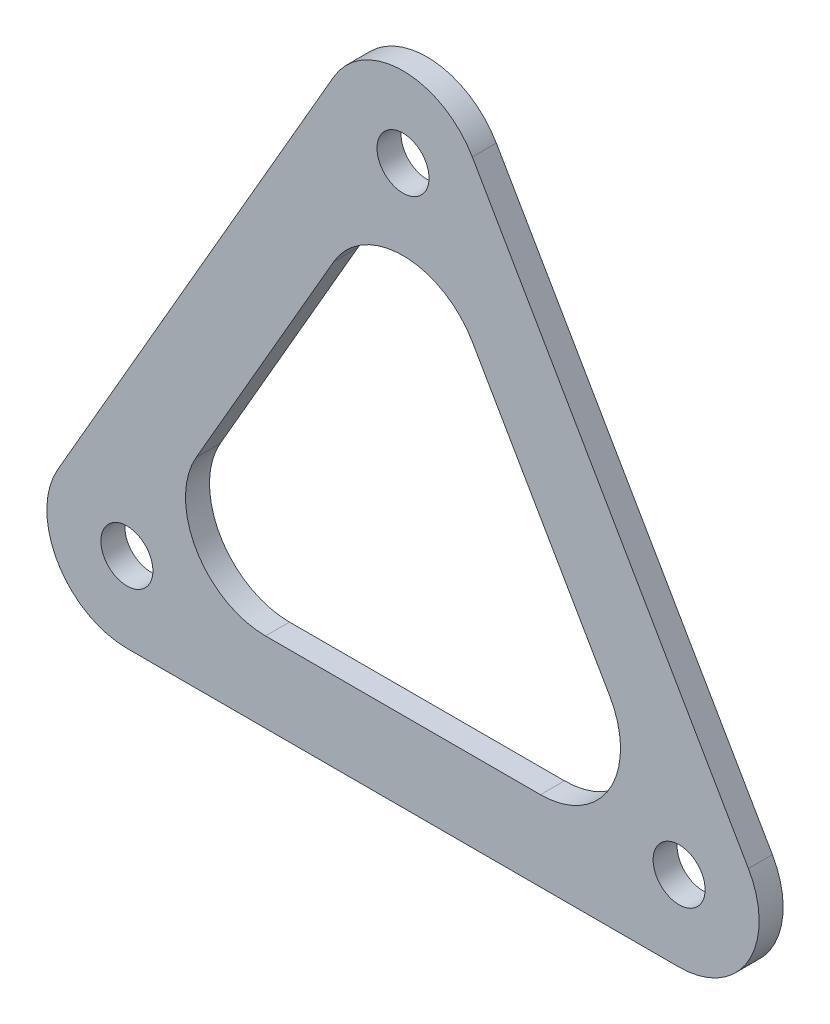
ISO-10303-21;
HEADER;
FILE_DESCRIPTION(('STEP AP214'),'2;1');
FILE_NAME('part.step','',(''),(''),'','','');
FILE_SCHEMA(('AUTOMOTIVE_DESIGN { 1 0 10303 214 1 1 1 1 }'));
ENDSEC;
DATA;
#1=APPLICATION_CONTEXT('core data for automotive mechanical design processes');
#2=APPLICATION_PROTOCOL_DEFINITION('international standard','automotive_design',2000,#1);
#3=PRODUCT_CONTEXT('',#1,'mechanical');
#4=PRODUCT('Part','Part','',(#3));
#5=PRODUCT_RELATED_PRODUCT_CATEGORY('part','',(#4));
#6=PRODUCT_DEFINITION_FORMATION('','',#4);
#7=PRODUCT_DEFINITION_CONTEXT('part definition',#1,'design');
#8=PRODUCT_DEFINITION('design','',#6,#7);
#9=PRODUCT_DEFINITION_SHAPE('','',#8);
#10=(LENGTH_UNIT() NAMED_UNIT(*) SI_UNIT(.MILLI.,.METRE.));
#11=(NAMED_UNIT(*) PLANE_ANGLE_UNIT() SI_UNIT($,.RADIAN.));
#12=(NAMED_UNIT(*) SI_UNIT($,.STERADIAN.) SOLID_ANGLE_UNIT());
#13=UNCERTAINTY_MEASURE_WITH_UNIT(LENGTH_MEASURE(1.E-05),#10,'distance_accuracy_value','');
#14=(GEOMETRIC_REPRESENTATION_CONTEXT(3) GLOBAL_UNCERTAINTY_ASSIGNED_CONTEXT((#13)) GLOBAL_UNIT_ASSIGNED_CONTEXT((#10,
#11,#12)) REPRESENTATION_CONTEXT('',''));
#15=CARTESIAN_POINT('',(0.,0.,0.));
#16=DIRECTION('',(0.,0.,1.));
#17=DIRECTION('',(1.,0.,0.));
#18=AXIS2_PLACEMENT_3D('',#15,#16,#17);
#19=CARTESIAN_POINT('',(86.3205080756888,-9.99999999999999,3.));
#20=DIRECTION('',(0.,0.,1.));
#21=DIRECTION('',(1.,0.,0.));
#22=AXIS2_PLACEMENT_3D('',#19,#20,#21);
#23=PLANE('',#22);
#24=CARTESIAN_POINT('',(0.,0.,3.));
#25=DIRECTION('',(0.,0.,1.));
#26=DIRECTION('',(1.,0.,0.));
#27=AXIS2_PLACEMENT_3D('',#24,#25,#26);
#28=CIRCLE('',#27,3.25);
#29=CARTESIAN_POINT('',(3.25,0.,3.));
#30=VERTEX_POINT('',#29);
#31=EDGE_CURVE('E178',#30,#30,#28,.T.);
#32=ORIENTED_EDGE('',*,*,#31,.F.);
#33=EDGE_LOOP('',(#32));
#34=FACE_BOUND('',#33,.T.);
#35=CARTESIAN_POINT('',(34.5,59.7557528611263,3.));
#36=DIRECTION('',(0.,0.,1.));
#37=DIRECTION('',(1.,0.,0.));
#38=AXIS2_PLACEMENT_3D('',#35,#36,#37);
#39=CIRCLE('',#38,3.25);
#40=CARTESIAN_POINT('',(37.75,59.7557528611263,3.));
#41=VERTEX_POINT('',#40);
#42=EDGE_CURVE('E190',#41,#41,#39,.T.);
#43=ORIENTED_EDGE('',*,*,#42,.F.);
#44=EDGE_LOOP('',(#43));
#45=FACE_BOUND('',#44,.T.);
#46=DIRECTION('',(-0.5,-0.866025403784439,0.));
#47=VECTOR('',#46,1.);
#48=CARTESIAN_POINT('',(34.5,79.7557528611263,3.));
#49=LINE('',#48,#47);
#50=CARTESIAN_POINT('',(25.8397459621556,64.7557528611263,3.));
#51=VERTEX_POINT('',#50);
#52=CARTESIAN_POINT('',(-8.66025403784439,4.99999999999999,3.));
#53=VERTEX_POINT('',#52);
#54=EDGE_CURVE('E201',#51,#53,#49,.T.);
#55=ORIENTED_EDGE('',*,*,#54,.T.);
#56=CARTESIAN_POINT('',(0.,0.,3.));
#57=DIRECTION('',(0.,0.,1.));
#58=DIRECTION('',(1.,0.,0.));
#59=AXIS2_PLACEMENT_3D('',#56,#57,#58);
#60=CIRCLE('',#59,10.);
#61=CARTESIAN_POINT('',(0.,-10.,3.));
#62=VERTEX_POINT('',#61);
#63=EDGE_CURVE('E229',#53,#62,#60,.T.);
#64=ORIENTED_EDGE('',*,*,#63,.T.);
#65=DIRECTION('',(1.,0.,0.));
#66=VECTOR('',#65,1.);
#67=CARTESIAN_POINT('',(-17.3205080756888,-10.,3.));
#68=LINE('',#67,#66);
#69=CARTESIAN_POINT('',(69.,-10.,3.));
#70=VERTEX_POINT('',#69);
#71=EDGE_CURVE('E196',#62,#70,#68,.T.);
#72=ORIENTED_EDGE('',*,*,#71,.T.);
#73=CARTESIAN_POINT('',(69.,0.,3.));
#74=DIRECTION('',(0.,0.,1.));
#75=DIRECTION('',(1.,0.,0.));
#76=AXIS2_PLACEMENT_3D('',#73,#74,#75);
#77=CIRCLE('',#76,10.);
#78=CARTESIAN_POINT('',(77.6602540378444,5.,3.));
#79=VERTEX_POINT('',#78);
#80=EDGE_CURVE('E52',#70,#79,#77,.T.);
#81=ORIENTED_EDGE('',*,*,#80,.T.);
#82=DIRECTION('',(-0.5,0.866025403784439,0.));
#83=VECTOR('',#82,1.);
#84=CARTESIAN_POINT('',(86.3205080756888,-10.,3.));
#85=LINE('',#84,#83);
#86=CARTESIAN_POINT('',(43.1602540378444,64.7557528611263,3.));
#87=VERTEX_POINT('',#86);
#88=EDGE_CURVE('E198',#79,#87,#85,.T.);
#89=ORIENTED_EDGE('',*,*,#88,.T.);
#90=CARTESIAN_POINT('',(34.5,59.7557528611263,3.));
#91=DIRECTION('',(0.,0.,1.));
#92=DIRECTION('',(1.,0.,0.));
#93=AXIS2_PLACEMENT_3D('',#90,#91,#92);
#94=CIRCLE('',#93,10.);
#95=EDGE_CURVE('E226',#87,#51,#94,.T.);
#96=ORIENTED_EDGE('',*,*,#95,.T.);
#97=EDGE_LOOP('',(#55,#64,#72,#81,#89,#96));
#98=FACE_BOUND('',#97,.T.);
#99=CARTESIAN_POINT('',(69.,0.,3.));
#100=DIRECTION('',(0.,0.,1.));
#101=DIRECTION('',(1.,0.,0.));
#102=AXIS2_PLACEMENT_3D('',#99,#100,#101);
#103=CIRCLE('',#102,3.25000000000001);
#104=CARTESIAN_POINT('',(72.25,0.,3.));
#105=VERTEX_POINT('',#104);
#106=EDGE_CURVE('E184',#105,#105,#103,.T.);
#107=ORIENTED_EDGE('',*,*,#106,.F.);
#108=EDGE_LOOP('',(#107));
#109=FACE_BOUND('',#108,.T.);
#110=DIRECTION('',(-0.5,-0.866025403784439,0.));
#111=VECTOR('',#110,1.);
#112=CARTESIAN_POINT('',(25.8397459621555,44.7557528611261,3.));
#113=LINE('',#112,#111);
#114=CARTESIAN_POINT('',(25.8397459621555,44.7557528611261,3.));
#115=VERTEX_POINT('',#114);
#116=CARTESIAN_POINT('',(8.66025403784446,15.0000000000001,3.));
#117=VERTEX_POINT('',#116);
#118=EDGE_CURVE('E132',#115,#117,#113,.T.);
#119=ORIENTED_EDGE('',*,*,#118,.F.);
#120=CARTESIAN_POINT('',(34.5,39.7557528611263,3.));
#121=DIRECTION('',(0.,0.,1.));
#122=DIRECTION('',(-1.,0.,0.));
#123=AXIS2_PLACEMENT_3D('',#120,#121,#122);
#124=CIRCLE('',#123,10.);
#125=CARTESIAN_POINT('',(43.1602540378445,44.7557528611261,3.));
#126=VERTEX_POINT('',#125);
#127=EDGE_CURVE('E122',#126,#115,#124,.T.);
#128=ORIENTED_EDGE('',*,*,#127,.F.);
#129=DIRECTION('',(-0.5,0.866025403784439,0.));
#130=VECTOR('',#129,1.);
#131=CARTESIAN_POINT('',(60.3397459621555,15.0000000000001,3.));
#132=LINE('',#131,#130);
#133=CARTESIAN_POINT('',(60.3397459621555,15.0000000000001,3.));
#134=VERTEX_POINT('',#133);
#135=EDGE_CURVE('E154',#134,#126,#132,.T.);
#136=ORIENTED_EDGE('',*,*,#135,.F.);
#137=CARTESIAN_POINT('',(51.6794919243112,10.,3.));
#138=DIRECTION('',(0.,0.,1.));
#139=DIRECTION('',(-1.,0.,0.));
#140=AXIS2_PLACEMENT_3D('',#137,#138,#139);
#141=CIRCLE('',#140,10.);
#142=CARTESIAN_POINT('',(51.6794919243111,0.,3.));
#143=VERTEX_POINT('',#142);
#144=EDGE_CURVE('E151',#143,#134,#141,.T.);
#145=ORIENTED_EDGE('',*,*,#144,.F.);
#146=DIRECTION('',(1.,0.,0.));
#147=VECTOR('',#146,1.);
#148=CARTESIAN_POINT('',(17.3205080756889,0.,3.));
#149=LINE('',#148,#147);
#150=CARTESIAN_POINT('',(17.3205080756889,0.,3.));
#151=VERTEX_POINT('',#150);
#152=EDGE_CURVE('E147',#151,#143,#149,.T.);
#153=ORIENTED_EDGE('',*,*,#152,.F.);
#154=CARTESIAN_POINT('',(17.3205080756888,10.,3.));
#155=DIRECTION('',(0.,0.,1.));
#156=DIRECTION('',(-1.,0.,0.));
#157=AXIS2_PLACEMENT_3D('',#154,#155,#156);
#158=CIRCLE('',#157,10.);
#159=EDGE_CURVE('E145',#117,#151,#158,.T.);
#160=ORIENTED_EDGE('',*,*,#159,.F.);
#161=EDGE_LOOP('',(#119,#128,#136,#145,#153,#160));
#162=FACE_BOUND('',#161,.T.);
#163=ADVANCED_FACE('F31',(#34,#45,#98,#109,#162),#23,.T.);
#164=CARTESIAN_POINT('',(86.3205080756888,-9.99999999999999,0.));
#165=DIRECTION('',(0.,0.,1.));
#166=DIRECTION('',(1.,0.,0.));
#167=AXIS2_PLACEMENT_3D('',#164,#165,#166);
#168=PLANE('',#167);
#169=CARTESIAN_POINT('',(0.,0.,0.));
#170=DIRECTION('',(0.,0.,1.));
#171=DIRECTION('',(1.,0.,0.));
#172=AXIS2_PLACEMENT_3D('',#169,#170,#171);
#173=CIRCLE('',#172,3.25);
#174=CARTESIAN_POINT('',(3.25,0.,0.));
#175=VERTEX_POINT('',#174);
#176=EDGE_CURVE('E140',#175,#175,#173,.T.);
#177=ORIENTED_EDGE('',*,*,#176,.T.);
#178=EDGE_LOOP('',(#177));
#179=FACE_BOUND('',#178,.T.);
#180=CARTESIAN_POINT('',(34.5,59.7557528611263,0.));
#181=DIRECTION('',(0.,0.,1.));
#182=DIRECTION('',(1.,0.,0.));
#183=AXIS2_PLACEMENT_3D('',#180,#181,#182);
#184=CIRCLE('',#183,3.25);
#185=CARTESIAN_POINT('',(37.75,59.7557528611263,0.));
#186=VERTEX_POINT('',#185);
#187=EDGE_CURVE('E187',#186,#186,#184,.T.);
#188=ORIENTED_EDGE('',*,*,#187,.T.);
#189=EDGE_LOOP('',(#188));
#190=FACE_BOUND('',#189,.T.);
#191=DIRECTION('',(1.,0.,0.));
#192=VECTOR('',#191,1.);
#193=CARTESIAN_POINT('',(-17.3205080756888,-10.,0.));
#194=LINE('',#193,#192);
#195=CARTESIAN_POINT('',(0.,-10.,0.));
#196=VERTEX_POINT('',#195);
#197=CARTESIAN_POINT('',(69.,-10.,0.));
#198=VERTEX_POINT('',#197);
#199=EDGE_CURVE('E193',#196,#198,#194,.T.);
#200=ORIENTED_EDGE('',*,*,#199,.F.);
#201=CARTESIAN_POINT('',(0.,0.,0.));
#202=DIRECTION('',(0.,0.,1.));
#203=DIRECTION('',(1.,0.,0.));
#204=AXIS2_PLACEMENT_3D('',#201,#202,#203);
#205=CIRCLE('',#204,10.);
#206=CARTESIAN_POINT('',(-8.66025403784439,4.99999999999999,0.));
#207=VERTEX_POINT('',#206);
#208=EDGE_CURVE('E219',#196,#207,#205,.F.);
#209=ORIENTED_EDGE('',*,*,#208,.T.);
#210=DIRECTION('',(-0.5,-0.866025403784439,0.));
#211=VECTOR('',#210,1.);
#212=CARTESIAN_POINT('',(34.5,79.7557528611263,0.));
#213=LINE('',#212,#211);
#214=CARTESIAN_POINT('',(25.8397459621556,64.7557528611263,0.));
#215=VERTEX_POINT('',#214);
#216=EDGE_CURVE('E199',#215,#207,#213,.T.);
#217=ORIENTED_EDGE('',*,*,#216,.F.);
#218=CARTESIAN_POINT('',(34.5,59.7557528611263,0.));
#219=DIRECTION('',(0.,0.,1.));
#220=DIRECTION('',(1.,0.,0.));
#221=AXIS2_PLACEMENT_3D('',#218,#219,#220);
#222=CIRCLE('',#221,10.);
#223=CARTESIAN_POINT('',(43.1602540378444,64.7557528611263,0.));
#224=VERTEX_POINT('',#223);
#225=EDGE_CURVE('E215',#215,#224,#222,.F.);
#226=ORIENTED_EDGE('',*,*,#225,.T.);
#227=DIRECTION('',(-0.5,0.866025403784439,0.));
#228=VECTOR('',#227,1.);
#229=CARTESIAN_POINT('',(86.3205080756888,-10.,0.));
#230=LINE('',#229,#228);
#231=CARTESIAN_POINT('',(77.6602540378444,5.,0.));
#232=VERTEX_POINT('',#231);
#233=EDGE_CURVE('E207',#232,#224,#230,.T.);
#234=ORIENTED_EDGE('',*,*,#233,.F.);
#235=CARTESIAN_POINT('',(69.,0.,0.));
#236=DIRECTION('',(0.,0.,1.));
#237=DIRECTION('',(1.,0.,0.));
#238=AXIS2_PLACEMENT_3D('',#235,#236,#237);
#239=CIRCLE('',#238,10.);
#240=EDGE_CURVE('E217',#232,#198,#239,.F.);
#241=ORIENTED_EDGE('',*,*,#240,.T.);
#242=EDGE_LOOP('',(#200,#209,#217,#226,#234,#241));
#243=FACE_BOUND('',#242,.T.);
#244=CARTESIAN_POINT('',(69.,0.,0.));
#245=DIRECTION('',(0.,0.,1.));
#246=DIRECTION('',(1.,0.,0.));
#247=AXIS2_PLACEMENT_3D('',#244,#245,#246);
#248=CIRCLE('',#247,3.25000000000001);
#249=CARTESIAN_POINT('',(72.25,0.,0.));
#250=VERTEX_POINT('',#249);
#251=EDGE_CURVE('E181',#250,#250,#248,.T.);
#252=ORIENTED_EDGE('',*,*,#251,.T.);
#253=EDGE_LOOP('',(#252));
#254=FACE_BOUND('',#253,.T.);
#255=CARTESIAN_POINT('',(34.5,39.7557528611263,0.));
#256=DIRECTION('',(0.,0.,1.));
#257=DIRECTION('',(-1.,0.,0.));
#258=AXIS2_PLACEMENT_3D('',#255,#256,#257);
#259=CIRCLE('',#258,10.);
#260=CARTESIAN_POINT('',(43.1602540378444,44.7557528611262,0.));
#261=VERTEX_POINT('',#260);
#262=CARTESIAN_POINT('',(25.8397459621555,44.7557528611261,0.));
#263=VERTEX_POINT('',#262);
#264=EDGE_CURVE('E156',#261,#263,#259,.T.);
#265=ORIENTED_EDGE('',*,*,#264,.T.);
#266=DIRECTION('',(-0.5,-0.866025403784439,0.));
#267=VECTOR('',#266,1.);
#268=CARTESIAN_POINT('',(25.8397459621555,44.7557528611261,0.));
#269=LINE('',#268,#267);
#270=CARTESIAN_POINT('',(8.66025403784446,15.0000000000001,0.));
#271=VERTEX_POINT('',#270);
#272=EDGE_CURVE('E139',#263,#271,#269,.T.);
#273=ORIENTED_EDGE('',*,*,#272,.T.);
#274=CARTESIAN_POINT('',(17.3205080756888,10.,0.));
#275=DIRECTION('',(0.,0.,1.));
#276=DIRECTION('',(-1.,0.,0.));
#277=AXIS2_PLACEMENT_3D('',#274,#275,#276);
#278=CIRCLE('',#277,10.);
#279=CARTESIAN_POINT('',(17.3205080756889,0.,0.));
#280=VERTEX_POINT('',#279);
#281=EDGE_CURVE('E159',#271,#280,#278,.T.);
#282=ORIENTED_EDGE('',*,*,#281,.T.);
#283=DIRECTION('',(1.,0.,0.));
#284=VECTOR('',#283,1.);
#285=CARTESIAN_POINT('',(17.3205080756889,0.,0.));
#286=LINE('',#285,#284);
#287=CARTESIAN_POINT('',(51.6794919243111,0.,0.));
#288=VERTEX_POINT('',#287);
#289=EDGE_CURVE('E162',#280,#288,#286,.T.);
#290=ORIENTED_EDGE('',*,*,#289,.T.);
#291=CARTESIAN_POINT('',(51.6794919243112,10.,0.));
#292=DIRECTION('',(0.,0.,1.));
#293=DIRECTION('',(-1.,0.,0.));
#294=AXIS2_PLACEMENT_3D('',#291,#292,#293);
#295=CIRCLE('',#294,10.);
#296=CARTESIAN_POINT('',(60.3397459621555,15.0000000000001,0.));
#297=VERTEX_POINT('',#296);
#298=EDGE_CURVE('E165',#288,#297,#295,.T.);
#299=ORIENTED_EDGE('',*,*,#298,.T.);
#300=DIRECTION('',(-0.5,0.866025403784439,0.));
#301=VECTOR('',#300,1.);
#302=CARTESIAN_POINT('',(60.3397459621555,15.0000000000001,0.));
#303=LINE('',#302,#301);
#304=EDGE_CURVE('E133',#297,#261,#303,.T.);
#305=ORIENTED_EDGE('',*,*,#304,.T.);
#306=EDGE_LOOP('',(#265,#273,#282,#290,#299,#305));
#307=FACE_BOUND('',#306,.T.);
#308=ADVANCED_FACE('F244',(#179,#190,#243,#254,#307),#168,.F.);
#309=CARTESIAN_POINT('',(-17.3205080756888,-10.,3.));
#310=DIRECTION('',(0.,1.,0.));
#311=DIRECTION('',(0.,0.,1.));
#312=AXIS2_PLACEMENT_3D('',#309,#310,#311);
#313=PLANE('',#312);
#314=ORIENTED_EDGE('',*,*,#71,.F.);
#315=DIRECTION('',(0.,0.,-1.));
#316=VECTOR('',#315,1.);
#317=CARTESIAN_POINT('',(0.,-10.,3.));
#318=LINE('',#317,#316);
#319=EDGE_CURVE('E212',#62,#196,#318,.T.);
#320=ORIENTED_EDGE('',*,*,#319,.T.);
#321=ORIENTED_EDGE('',*,*,#199,.T.);
#322=DIRECTION('',(0.,0.,-1.));
#323=VECTOR('',#322,1.);
#324=CARTESIAN_POINT('',(69.,-10.,3.));
#325=LINE('',#324,#323);
#326=EDGE_CURVE('E204',#198,#70,#325,.F.);
#327=ORIENTED_EDGE('',*,*,#326,.T.);
#328=EDGE_LOOP('',(#314,#320,#321,#327));
#329=FACE_BOUND('',#328,.T.);
#330=ADVANCED_FACE('F238',(#329),#313,.F.);
#331=CARTESIAN_POINT('',(86.3205080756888,-10.,3.));
#332=DIRECTION('',(-0.866025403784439,-0.5,0.));
#333=DIRECTION('',(0.5,-0.866025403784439,0.));
#334=AXIS2_PLACEMENT_3D('',#331,#332,#333);
#335=PLANE('',#334);
#336=ORIENTED_EDGE('',*,*,#88,.F.);
#337=DIRECTION('',(0.,0.,-1.));
#338=VECTOR('',#337,1.);
#339=CARTESIAN_POINT('',(77.6602540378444,5.,3.));
#340=LINE('',#339,#338);
#341=EDGE_CURVE('E11',#79,#232,#340,.T.);
#342=ORIENTED_EDGE('',*,*,#341,.T.);
#343=ORIENTED_EDGE('',*,*,#233,.T.);
#344=DIRECTION('',(0.,0.,-1.));
#345=VECTOR('',#344,1.);
#346=CARTESIAN_POINT('',(43.1602540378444,64.7557528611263,3.));
#347=LINE('',#346,#345);
#348=EDGE_CURVE('E39',#224,#87,#347,.F.);
#349=ORIENTED_EDGE('',*,*,#348,.T.);
#350=EDGE_LOOP('',(#336,#342,#343,#349));
#351=FACE_BOUND('',#350,.T.);
#352=ADVANCED_FACE('F252',(#351),#335,.F.);
#353=CARTESIAN_POINT('',(34.5,79.7557528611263,3.));
#354=DIRECTION('',(0.866025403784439,-0.5,0.));
#355=DIRECTION('',(0.5,0.866025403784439,0.));
#356=AXIS2_PLACEMENT_3D('',#353,#354,#355);
#357=PLANE('',#356);
#358=ORIENTED_EDGE('',*,*,#216,.T.);
#359=DIRECTION('',(0.,0.,-1.));
#360=VECTOR('',#359,1.);
#361=CARTESIAN_POINT('',(-8.66025403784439,5.,3.));
#362=LINE('',#361,#360);
#363=EDGE_CURVE('E224',#207,#53,#362,.F.);
#364=ORIENTED_EDGE('',*,*,#363,.T.);
#365=ORIENTED_EDGE('',*,*,#54,.F.);
#366=DIRECTION('',(0.,0.,-1.));
#367=VECTOR('',#366,1.);
#368=CARTESIAN_POINT('',(25.8397459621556,64.7557528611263,3.));
#369=LINE('',#368,#367);
#370=EDGE_CURVE('E221',#51,#215,#369,.T.);
#371=ORIENTED_EDGE('',*,*,#370,.T.);
#372=EDGE_LOOP('',(#358,#364,#365,#371));
#373=FACE_BOUND('',#372,.T.);
#374=ADVANCED_FACE('F247',(#373),#357,.F.);
#375=CARTESIAN_POINT('',(34.5,59.7557528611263,3.));
#376=DIRECTION('',(0.,0.,-1.));
#377=DIRECTION('',(-1.,0.,0.));
#378=AXIS2_PLACEMENT_3D('',#375,#376,#377);
#379=CYLINDRICAL_SURFACE('',#378,3.25);
#380=ORIENTED_EDGE('',*,*,#42,.T.);
#381=EDGE_LOOP('',(#380));
#382=FACE_BOUND('',#381,.T.);
#383=ORIENTED_EDGE('',*,*,#187,.F.);
#384=EDGE_LOOP('',(#383));
#385=FACE_BOUND('',#384,.T.);
#386=ADVANCED_FACE('F274',(#382,#385),#379,.F.);
#387=CARTESIAN_POINT('',(69.,0.,3.));
#388=DIRECTION('',(0.,0.,-1.));
#389=DIRECTION('',(-1.,0.,0.));
#390=AXIS2_PLACEMENT_3D('',#387,#388,#389);
#391=CYLINDRICAL_SURFACE('',#390,3.25000000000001);
#392=ORIENTED_EDGE('',*,*,#106,.T.);
#393=EDGE_LOOP('',(#392));
#394=FACE_BOUND('',#393,.T.);
#395=ORIENTED_EDGE('',*,*,#251,.F.);
#396=EDGE_LOOP('',(#395));
#397=FACE_BOUND('',#396,.T.);
#398=ADVANCED_FACE('F301',(#394,#397),#391,.F.);
#399=CARTESIAN_POINT('',(0.,0.,3.));
#400=DIRECTION('',(0.,0.,-1.));
#401=DIRECTION('',(-1.,0.,0.));
#402=AXIS2_PLACEMENT_3D('',#399,#400,#401);
#403=CYLINDRICAL_SURFACE('',#402,3.25);
#404=ORIENTED_EDGE('',*,*,#31,.T.);
#405=EDGE_LOOP('',(#404));
#406=FACE_BOUND('',#405,.T.);
#407=ORIENTED_EDGE('',*,*,#176,.F.);
#408=EDGE_LOOP('',(#407));
#409=FACE_BOUND('',#408,.T.);
#410=ADVANCED_FACE('F308',(#406,#409),#403,.F.);
#411=CARTESIAN_POINT('',(34.5,39.7557528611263,3.));
#412=DIRECTION('',(0.,0.,-1.));
#413=DIRECTION('',(-1.,0.,0.));
#414=AXIS2_PLACEMENT_3D('',#411,#412,#413);
#415=CYLINDRICAL_SURFACE('',#414,10.);
#416=ORIENTED_EDGE('',*,*,#264,.F.);
#417=DIRECTION('',(0.,0.,-1.));
#418=VECTOR('',#417,1.);
#419=CARTESIAN_POINT('',(43.1602540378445,44.7557528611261,3.));
#420=LINE('',#419,#418);
#421=EDGE_CURVE('E128',#126,#261,#420,.T.);
#422=ORIENTED_EDGE('',*,*,#421,.F.);
#423=ORIENTED_EDGE('',*,*,#127,.T.);
#424=DIRECTION('',(0.,0.,-1.));
#425=VECTOR('',#424,1.);
#426=CARTESIAN_POINT('',(25.8397459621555,44.7557528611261,3.));
#427=LINE('',#426,#425);
#428=EDGE_CURVE('E125',#115,#263,#427,.T.);
#429=ORIENTED_EDGE('',*,*,#428,.T.);
#430=EDGE_LOOP('',(#416,#422,#423,#429));
#431=FACE_BOUND('',#430,.T.);
#432=ADVANCED_FACE('F124',(#431),#415,.F.);
#433=CARTESIAN_POINT('',(25.8397459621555,44.7557528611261,3.));
#434=DIRECTION('',(0.866025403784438,-0.5,0.));
#435=DIRECTION('',(0.5,0.866025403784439,0.));
#436=AXIS2_PLACEMENT_3D('',#433,#434,#435);
#437=PLANE('',#436);
#438=ORIENTED_EDGE('',*,*,#272,.F.);
#439=ORIENTED_EDGE('',*,*,#428,.F.);
#440=ORIENTED_EDGE('',*,*,#118,.T.);
#441=DIRECTION('',(0.,0.,-1.));
#442=VECTOR('',#441,1.);
#443=CARTESIAN_POINT('',(8.66025403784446,15.0000000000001,3.));
#444=LINE('',#443,#442);
#445=EDGE_CURVE('E141',#117,#271,#444,.T.);
#446=ORIENTED_EDGE('',*,*,#445,.T.);
#447=EDGE_LOOP('',(#438,#439,#440,#446));
#448=FACE_BOUND('',#447,.T.);
#449=ADVANCED_FACE('F136',(#448),#437,.T.);
#450=CARTESIAN_POINT('',(17.3205080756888,10.,3.));
#451=DIRECTION('',(0.,0.,-1.));
#452=DIRECTION('',(-1.,0.,0.));
#453=AXIS2_PLACEMENT_3D('',#450,#451,#452);
#454=CYLINDRICAL_SURFACE('',#453,10.);
#455=ORIENTED_EDGE('',*,*,#281,.F.);
#456=ORIENTED_EDGE('',*,*,#445,.F.);
#457=ORIENTED_EDGE('',*,*,#159,.T.);
#458=DIRECTION('',(0.,0.,-1.));
#459=VECTOR('',#458,1.);
#460=CARTESIAN_POINT('',(17.3205080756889,0.,3.));
#461=LINE('',#460,#459);
#462=EDGE_CURVE('E175',#151,#280,#461,.T.);
#463=ORIENTED_EDGE('',*,*,#462,.T.);
#464=EDGE_LOOP('',(#455,#456,#457,#463));
#465=FACE_BOUND('',#464,.T.);
#466=ADVANCED_FACE('F328',(#465),#454,.F.);
#467=CARTESIAN_POINT('',(17.3205080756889,0.,3.));
#468=DIRECTION('',(0.,1.,0.));
#469=DIRECTION('',(0.,0.,1.));
#470=AXIS2_PLACEMENT_3D('',#467,#468,#469);
#471=PLANE('',#470);
#472=ORIENTED_EDGE('',*,*,#289,.F.);
#473=ORIENTED_EDGE('',*,*,#462,.F.);
#474=ORIENTED_EDGE('',*,*,#152,.T.);
#475=DIRECTION('',(0.,0.,-1.));
#476=VECTOR('',#475,1.);
#477=CARTESIAN_POINT('',(51.6794919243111,0.,3.));
#478=LINE('',#477,#476);
#479=EDGE_CURVE('E173',#143,#288,#478,.T.);
#480=ORIENTED_EDGE('',*,*,#479,.T.);
#481=EDGE_LOOP('',(#472,#473,#474,#480));
#482=FACE_BOUND('',#481,.T.);
#483=ADVANCED_FACE('F335',(#482),#471,.T.);
#484=CARTESIAN_POINT('',(51.6794919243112,10.,3.));
#485=DIRECTION('',(0.,0.,-1.));
#486=DIRECTION('',(-1.,0.,0.));
#487=AXIS2_PLACEMENT_3D('',#484,#485,#486);
#488=CYLINDRICAL_SURFACE('',#487,10.);
#489=ORIENTED_EDGE('',*,*,#298,.F.);
#490=ORIENTED_EDGE('',*,*,#479,.F.);
#491=ORIENTED_EDGE('',*,*,#144,.T.);
#492=DIRECTION('',(0.,0.,-1.));
#493=VECTOR('',#492,1.);
#494=CARTESIAN_POINT('',(60.3397459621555,15.0000000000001,3.));
#495=LINE('',#494,#493);
#496=EDGE_CURVE('E171',#134,#297,#495,.T.);
#497=ORIENTED_EDGE('',*,*,#496,.T.);
#498=EDGE_LOOP('',(#489,#490,#491,#497));
#499=FACE_BOUND('',#498,.T.);
#500=ADVANCED_FACE('F343',(#499),#488,.F.);
#501=CARTESIAN_POINT('',(60.3397459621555,15.0000000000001,3.));
#502=DIRECTION('',(-0.866025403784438,-0.5,0.));
#503=DIRECTION('',(0.5,-0.866025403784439,0.));
#504=AXIS2_PLACEMENT_3D('',#501,#502,#503);
#505=PLANE('',#504);
#506=ORIENTED_EDGE('',*,*,#304,.F.);
#507=ORIENTED_EDGE('',*,*,#496,.F.);
#508=ORIENTED_EDGE('',*,*,#135,.T.);
#509=ORIENTED_EDGE('',*,*,#421,.T.);
#510=EDGE_LOOP('',(#506,#507,#508,#509));
#511=FACE_BOUND('',#510,.T.);
#512=ADVANCED_FACE('F261',(#511),#505,.T.);
#513=CARTESIAN_POINT('',(0.,0.,3.));
#514=DIRECTION('',(0.,0.,-1.));
#515=DIRECTION('',(-1.,0.,0.));
#516=AXIS2_PLACEMENT_3D('',#513,#514,#515);
#517=CYLINDRICAL_SURFACE('',#516,10.);
#518=ORIENTED_EDGE('',*,*,#63,.F.);
#519=ORIENTED_EDGE('',*,*,#363,.F.);
#520=ORIENTED_EDGE('',*,*,#208,.F.);
#521=ORIENTED_EDGE('',*,*,#319,.F.);
#522=EDGE_LOOP('',(#518,#519,#520,#521));
#523=FACE_BOUND('',#522,.T.);
#524=ADVANCED_FACE('F241',(#523),#517,.T.);
#525=CARTESIAN_POINT('',(69.,0.,3.));
#526=DIRECTION('',(0.,0.,-1.));
#527=DIRECTION('',(-1.,0.,0.));
#528=AXIS2_PLACEMENT_3D('',#525,#526,#527);
#529=CYLINDRICAL_SURFACE('',#528,10.);
#530=ORIENTED_EDGE('',*,*,#80,.F.);
#531=ORIENTED_EDGE('',*,*,#326,.F.);
#532=ORIENTED_EDGE('',*,*,#240,.F.);
#533=ORIENTED_EDGE('',*,*,#341,.F.);
#534=EDGE_LOOP('',(#530,#531,#532,#533));
#535=FACE_BOUND('',#534,.T.);
#536=ADVANCED_FACE('F255',(#535),#529,.T.);
#537=CARTESIAN_POINT('',(34.5,59.7557528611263,3.));
#538=DIRECTION('',(0.,0.,-1.));
#539=DIRECTION('',(-1.,0.,0.));
#540=AXIS2_PLACEMENT_3D('',#537,#538,#539);
#541=CYLINDRICAL_SURFACE('',#540,10.);
#542=ORIENTED_EDGE('',*,*,#95,.F.);
#543=ORIENTED_EDGE('',*,*,#348,.F.);
#544=ORIENTED_EDGE('',*,*,#225,.F.);
#545=ORIENTED_EDGE('',*,*,#370,.F.);
#546=EDGE_LOOP('',(#542,#543,#544,#545));
#547=FACE_BOUND('',#546,.T.);
#548=ADVANCED_FACE('F33',(#547),#541,.T.);
#549=CLOSED_SHELL('',(#163,#308,#330,#352,#374,#386,#398,#410,#432,#449,#466,#483,#500,#512,
#524,#536,#548));
#550=MANIFOLD_SOLID_BREP('B2',#549);
#551=ADVANCED_BREP_SHAPE_REPRESENTATION('',(#18,#550),#14);
#552=SHAPE_DEFINITION_REPRESENTATION(#9,#551);
ENDSEC;
END-ISO-10303-21;
